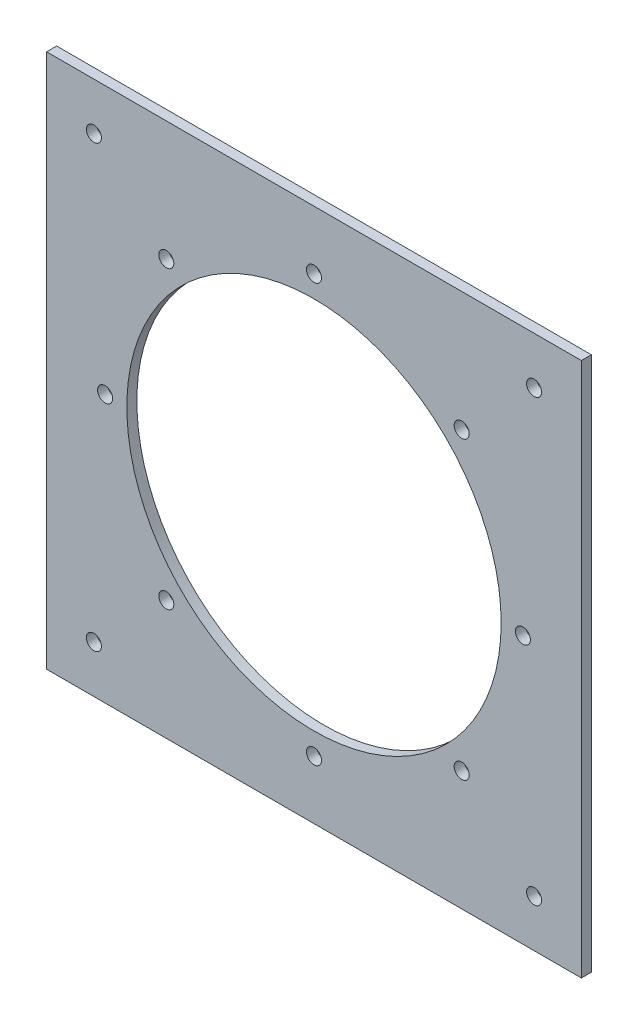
from build123d import *

# Parameters (mm, degrees)
ESQUISSE1_W          = 160
ESQUISSE1_H          = 160
ESQUISSE1_R          = 56
BOSS_EXTRU_1_DEPTH   = 3
M4_CLEARANCE_HOLE1_D = 4.5


with BuildPart() as part:
    # Esquisse1 → Boss.-Extru.1 (new body)
    with BuildSketch(Plane.XY):
        Rectangle(ESQUISSE1_W, ESQUISSE1_H)
        Circle(ESQUISSE1_R, mode=Mode.SUBTRACT)
    extrude(amount=BOSS_EXTRU_1_DEPTH)

    # M4 Clearance Hole1 (through all)
    with Locations(Plane(origin=(0, 0, 0), x_dir=(-1, 0, 0), z_dir=(0, 0, -1))):
        with Locations((0, 62.5), (44.194173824, 44.194173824), (62.5, 0), (44.194173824, -44.194173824), (0, -62.5), (-44.194173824, -44.194173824), (-62.5, 0), (-44.194173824, 44.194173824), (-65.857864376, 65.857864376), (65.857864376, 65.857864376), (65.857864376, -65.857864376), (-65.857864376, -65.857864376)):
            Hole(M4_CLEARANCE_HOLE1_D / 2)


solid = part.part
